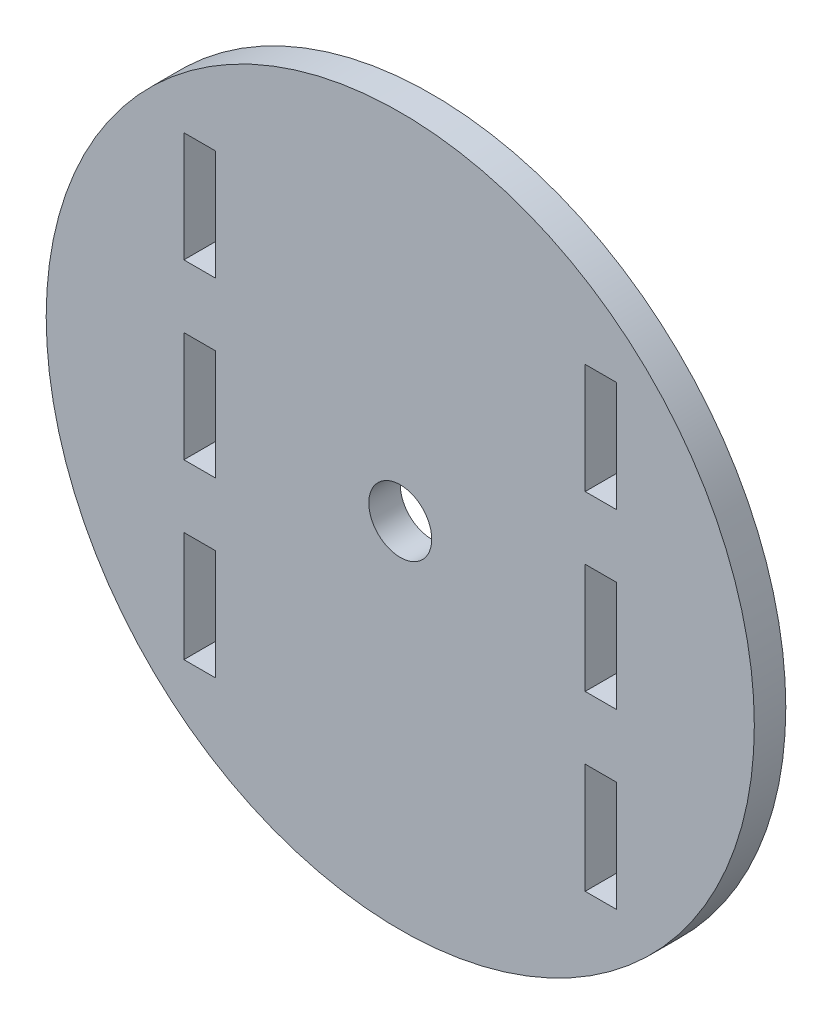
ISO-10303-21;
HEADER;
FILE_DESCRIPTION(('STEP AP214'),'2;1');
FILE_NAME('part.step','',(''),(''),'','','');
FILE_SCHEMA(('AUTOMOTIVE_DESIGN { 1 0 10303 214 1 1 1 1 }'));
ENDSEC;
DATA;
#1=APPLICATION_CONTEXT('core data for automotive mechanical design processes');
#2=APPLICATION_PROTOCOL_DEFINITION('international standard','automotive_design',2000,#1);
#3=PRODUCT_CONTEXT('',#1,'mechanical');
#4=PRODUCT('Part','Part','',(#3));
#5=PRODUCT_RELATED_PRODUCT_CATEGORY('part','',(#4));
#6=PRODUCT_DEFINITION_FORMATION('','',#4);
#7=PRODUCT_DEFINITION_CONTEXT('part definition',#1,'design');
#8=PRODUCT_DEFINITION('design','',#6,#7);
#9=PRODUCT_DEFINITION_SHAPE('','',#8);
#10=(LENGTH_UNIT() NAMED_UNIT(*) SI_UNIT(.MILLI.,.METRE.));
#11=(NAMED_UNIT(*) PLANE_ANGLE_UNIT() SI_UNIT($,.RADIAN.));
#12=(NAMED_UNIT(*) SI_UNIT($,.STERADIAN.) SOLID_ANGLE_UNIT());
#13=UNCERTAINTY_MEASURE_WITH_UNIT(LENGTH_MEASURE(1.E-05),#10,'distance_accuracy_value','');
#14=(GEOMETRIC_REPRESENTATION_CONTEXT(3) GLOBAL_UNCERTAINTY_ASSIGNED_CONTEXT((#13)) GLOBAL_UNIT_ASSIGNED_CONTEXT((#10,
#11,#12)) REPRESENTATION_CONTEXT('',''));
#15=CARTESIAN_POINT('',(0.,0.,0.));
#16=DIRECTION('',(0.,0.,1.));
#17=DIRECTION('',(1.,0.,0.));
#18=AXIS2_PLACEMENT_3D('',#15,#16,#17);
#19=CARTESIAN_POINT('',(45.,147.508099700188,4.));
#20=DIRECTION('',(0.,0.,1.));
#21=DIRECTION('',(1.,0.,0.));
#22=AXIS2_PLACEMENT_3D('',#19,#20,#21);
#23=PLANE('',#22);
#24=CARTESIAN_POINT('',(45.,147.508099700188,4.));
#25=DIRECTION('',(0.,0.,1.));
#26=DIRECTION('',(1.,0.,0.));
#27=AXIS2_PLACEMENT_3D('',#24,#25,#26);
#28=CIRCLE('',#27,45.);
#29=CARTESIAN_POINT('',(90.,147.508099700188,4.));
#30=VERTEX_POINT('',#29);
#31=EDGE_CURVE('E11',#30,#30,#28,.T.);
#32=ORIENTED_EDGE('',*,*,#31,.T.);
#33=EDGE_LOOP('',(#32));
#34=FACE_BOUND('',#33,.T.);
#35=DIRECTION('',(-1.,0.,0.));
#36=VECTOR('',#35,1.);
#37=CARTESIAN_POINT('',(45.,176.508099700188,4.));
#38=LINE('',#37,#36);
#39=CARTESIAN_POINT('',(72.5,176.508099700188,4.));
#40=VERTEX_POINT('',#39);
#41=CARTESIAN_POINT('',(68.5,176.508099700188,4.));
#42=VERTEX_POINT('',#41);
#43=EDGE_CURVE('E375',#40,#42,#38,.T.);
#44=ORIENTED_EDGE('',*,*,#43,.F.);
#45=DIRECTION('',(0.,1.,0.));
#46=VECTOR('',#45,1.);
#47=CARTESIAN_POINT('',(72.5,147.508099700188,4.));
#48=LINE('',#47,#46);
#49=CARTESIAN_POINT('',(72.5,162.508099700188,4.));
#50=VERTEX_POINT('',#49);
#51=EDGE_CURVE('E361',#50,#40,#48,.T.);
#52=ORIENTED_EDGE('',*,*,#51,.F.);
#53=DIRECTION('',(-1.,0.,0.));
#54=VECTOR('',#53,1.);
#55=CARTESIAN_POINT('',(45.,162.508099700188,4.));
#56=LINE('',#55,#54);
#57=CARTESIAN_POINT('',(68.5,162.508099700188,4.));
#58=VERTEX_POINT('',#57);
#59=EDGE_CURVE('E369',#50,#58,#56,.T.);
#60=ORIENTED_EDGE('',*,*,#59,.T.);
#61=DIRECTION('',(0.,1.,0.));
#62=VECTOR('',#61,1.);
#63=CARTESIAN_POINT('',(68.5,147.508099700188,4.));
#64=LINE('',#63,#62);
#65=EDGE_CURVE('E372',#58,#42,#64,.T.);
#66=ORIENTED_EDGE('',*,*,#65,.T.);
#67=EDGE_LOOP('',(#44,#52,#60,#66));
#68=FACE_BOUND('',#67,.T.);
#69=DIRECTION('',(1.,0.,0.));
#70=VECTOR('',#69,1.);
#71=CARTESIAN_POINT('',(45.,140.508099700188,4.));
#72=LINE('',#71,#70);
#73=CARTESIAN_POINT('',(68.5,140.508099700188,4.));
#74=VERTEX_POINT('',#73);
#75=CARTESIAN_POINT('',(72.5,140.508099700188,4.));
#76=VERTEX_POINT('',#75);
#77=EDGE_CURVE('E345',#74,#76,#72,.T.);
#78=ORIENTED_EDGE('',*,*,#77,.F.);
#79=DIRECTION('',(0.,-1.,0.));
#80=VECTOR('',#79,1.);
#81=CARTESIAN_POINT('',(68.5,147.508099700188,4.));
#82=LINE('',#81,#80);
#83=CARTESIAN_POINT('',(68.5,154.508099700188,4.));
#84=VERTEX_POINT('',#83);
#85=EDGE_CURVE('E338',#84,#74,#82,.T.);
#86=ORIENTED_EDGE('',*,*,#85,.F.);
#87=DIRECTION('',(-1.,0.,0.));
#88=VECTOR('',#87,1.);
#89=CARTESIAN_POINT('',(45.,154.508099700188,4.));
#90=LINE('',#89,#88);
#91=CARTESIAN_POINT('',(72.5,154.508099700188,4.));
#92=VERTEX_POINT('',#91);
#93=EDGE_CURVE('E340',#92,#84,#90,.T.);
#94=ORIENTED_EDGE('',*,*,#93,.F.);
#95=DIRECTION('',(0.,1.,0.));
#96=VECTOR('',#95,1.);
#97=CARTESIAN_POINT('',(72.5,147.508099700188,4.));
#98=LINE('',#97,#96);
#99=EDGE_CURVE('E343',#76,#92,#98,.T.);
#100=ORIENTED_EDGE('',*,*,#99,.F.);
#101=EDGE_LOOP('',(#78,#86,#94,#100));
#102=FACE_BOUND('',#101,.T.);
#103=DIRECTION('',(-1.,0.,0.));
#104=VECTOR('',#103,1.);
#105=CARTESIAN_POINT('',(45.,132.508099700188,4.));
#106=LINE('',#105,#104);
#107=CARTESIAN_POINT('',(72.5,132.508099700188,4.));
#108=VERTEX_POINT('',#107);
#109=CARTESIAN_POINT('',(68.5,132.508099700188,4.));
#110=VERTEX_POINT('',#109);
#111=EDGE_CURVE('E316',#108,#110,#106,.T.);
#112=ORIENTED_EDGE('',*,*,#111,.F.);
#113=DIRECTION('',(0.,1.,0.));
#114=VECTOR('',#113,1.);
#115=CARTESIAN_POINT('',(72.5,147.508099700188,4.));
#116=LINE('',#115,#114);
#117=CARTESIAN_POINT('',(72.5,118.508099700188,4.));
#118=VERTEX_POINT('',#117);
#119=EDGE_CURVE('E308',#118,#108,#116,.T.);
#120=ORIENTED_EDGE('',*,*,#119,.F.);
#121=DIRECTION('',(1.,0.,0.));
#122=VECTOR('',#121,1.);
#123=CARTESIAN_POINT('',(45.,118.508099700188,4.));
#124=LINE('',#123,#122);
#125=CARTESIAN_POINT('',(68.5,118.508099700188,4.));
#126=VERTEX_POINT('',#125);
#127=EDGE_CURVE('E310',#126,#118,#124,.T.);
#128=ORIENTED_EDGE('',*,*,#127,.F.);
#129=DIRECTION('',(0.,1.,0.));
#130=VECTOR('',#129,1.);
#131=CARTESIAN_POINT('',(68.5,147.508099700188,4.));
#132=LINE('',#131,#130);
#133=EDGE_CURVE('E313',#126,#110,#132,.T.);
#134=ORIENTED_EDGE('',*,*,#133,.T.);
#135=EDGE_LOOP('',(#112,#120,#128,#134));
#136=FACE_BOUND('',#135,.T.);
#137=DIRECTION('',(-1.,0.,0.));
#138=VECTOR('',#137,1.);
#139=CARTESIAN_POINT('',(45.,176.508099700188,4.));
#140=LINE('',#139,#138);
#141=CARTESIAN_POINT('',(21.5,176.508099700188,4.));
#142=VERTEX_POINT('',#141);
#143=CARTESIAN_POINT('',(17.5,176.508099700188,4.));
#144=VERTEX_POINT('',#143);
#145=EDGE_CURVE('E286',#142,#144,#140,.T.);
#146=ORIENTED_EDGE('',*,*,#145,.F.);
#147=DIRECTION('',(0.,1.,0.));
#148=VECTOR('',#147,1.);
#149=CARTESIAN_POINT('',(21.5,147.508099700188,4.));
#150=LINE('',#149,#148);
#151=CARTESIAN_POINT('',(21.5,162.508099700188,4.));
#152=VERTEX_POINT('',#151);
#153=EDGE_CURVE('E279',#152,#142,#150,.T.);
#154=ORIENTED_EDGE('',*,*,#153,.F.);
#155=DIRECTION('',(-1.,0.,0.));
#156=VECTOR('',#155,1.);
#157=CARTESIAN_POINT('',(45.,162.508099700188,4.));
#158=LINE('',#157,#156);
#159=CARTESIAN_POINT('',(17.5,162.508099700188,4.));
#160=VERTEX_POINT('',#159);
#161=EDGE_CURVE('E281',#152,#160,#158,.T.);
#162=ORIENTED_EDGE('',*,*,#161,.T.);
#163=DIRECTION('',(0.,-1.,0.));
#164=VECTOR('',#163,1.);
#165=CARTESIAN_POINT('',(17.5,147.508099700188,4.));
#166=LINE('',#165,#164);
#167=EDGE_CURVE('E284',#144,#160,#166,.T.);
#168=ORIENTED_EDGE('',*,*,#167,.F.);
#169=EDGE_LOOP('',(#146,#154,#162,#168));
#170=FACE_BOUND('',#169,.T.);
#171=DIRECTION('',(-1.,0.,0.));
#172=VECTOR('',#171,1.);
#173=CARTESIAN_POINT('',(45.,154.508099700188,4.));
#174=LINE('',#173,#172);
#175=CARTESIAN_POINT('',(21.5,154.508099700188,4.));
#176=VERTEX_POINT('',#175);
#177=CARTESIAN_POINT('',(17.5,154.508099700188,4.));
#178=VERTEX_POINT('',#177);
#179=EDGE_CURVE('E257',#176,#178,#174,.T.);
#180=ORIENTED_EDGE('',*,*,#179,.F.);
#181=DIRECTION('',(0.,1.,0.));
#182=VECTOR('',#181,1.);
#183=CARTESIAN_POINT('',(21.5,147.508099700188,4.));
#184=LINE('',#183,#182);
#185=CARTESIAN_POINT('',(21.5,140.508099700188,4.));
#186=VERTEX_POINT('',#185);
#187=EDGE_CURVE('E250',#186,#176,#184,.T.);
#188=ORIENTED_EDGE('',*,*,#187,.F.);
#189=DIRECTION('',(1.,0.,0.));
#190=VECTOR('',#189,1.);
#191=CARTESIAN_POINT('',(45.,140.508099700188,4.));
#192=LINE('',#191,#190);
#193=CARTESIAN_POINT('',(17.5,140.508099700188,4.));
#194=VERTEX_POINT('',#193);
#195=EDGE_CURVE('E252',#194,#186,#192,.T.);
#196=ORIENTED_EDGE('',*,*,#195,.F.);
#197=DIRECTION('',(0.,-1.,0.));
#198=VECTOR('',#197,1.);
#199=CARTESIAN_POINT('',(17.5,147.508099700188,4.));
#200=LINE('',#199,#198);
#201=EDGE_CURVE('E255',#178,#194,#200,.T.);
#202=ORIENTED_EDGE('',*,*,#201,.F.);
#203=EDGE_LOOP('',(#180,#188,#196,#202));
#204=FACE_BOUND('',#203,.T.);
#205=DIRECTION('',(-1.,0.,0.));
#206=VECTOR('',#205,1.);
#207=CARTESIAN_POINT('',(45.,132.508099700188,4.));
#208=LINE('',#207,#206);
#209=CARTESIAN_POINT('',(21.5,132.508099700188,4.));
#210=VERTEX_POINT('',#209);
#211=CARTESIAN_POINT('',(17.5,132.508099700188,4.));
#212=VERTEX_POINT('',#211);
#213=EDGE_CURVE('E198',#210,#212,#208,.T.);
#214=ORIENTED_EDGE('',*,*,#213,.F.);
#215=DIRECTION('',(0.,1.,0.));
#216=VECTOR('',#215,1.);
#217=CARTESIAN_POINT('',(21.5,147.508099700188,4.));
#218=LINE('',#217,#216);
#219=CARTESIAN_POINT('',(21.5,118.508099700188,4.));
#220=VERTEX_POINT('',#219);
#221=EDGE_CURVE('E218',#220,#210,#218,.T.);
#222=ORIENTED_EDGE('',*,*,#221,.F.);
#223=DIRECTION('',(-1.,0.,0.));
#224=VECTOR('',#223,1.);
#225=CARTESIAN_POINT('',(45.,118.508099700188,4.));
#226=LINE('',#225,#224);
#227=CARTESIAN_POINT('',(17.5,118.508099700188,4.));
#228=VERTEX_POINT('',#227);
#229=EDGE_CURVE('E220',#220,#228,#226,.T.);
#230=ORIENTED_EDGE('',*,*,#229,.T.);
#231=DIRECTION('',(0.,1.,0.));
#232=VECTOR('',#231,1.);
#233=CARTESIAN_POINT('',(17.5,147.508099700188,4.));
#234=LINE('',#233,#232);
#235=EDGE_CURVE('E227',#228,#212,#234,.T.);
#236=ORIENTED_EDGE('',*,*,#235,.T.);
#237=EDGE_LOOP('',(#214,#222,#230,#236));
#238=FACE_BOUND('',#237,.T.);
#239=CARTESIAN_POINT('',(45.,147.508099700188,4.));
#240=DIRECTION('',(0.,0.,1.));
#241=DIRECTION('',(1.,0.,0.));
#242=AXIS2_PLACEMENT_3D('',#239,#240,#241);
#243=CIRCLE('',#242,4.);
#244=CARTESIAN_POINT('',(49.,147.508099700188,4.));
#245=VERTEX_POINT('',#244);
#246=EDGE_CURVE('E202',#245,#245,#243,.F.);
#247=ORIENTED_EDGE('',*,*,#246,.T.);
#248=EDGE_LOOP('',(#247));
#249=FACE_BOUND('',#248,.T.);
#250=ADVANCED_FACE('F34',(#34,#68,#102,#136,#170,#204,#238,#249),#23,.T.);
#251=CARTESIAN_POINT('',(45.,147.508099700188,0.));
#252=DIRECTION('',(0.,0.,1.));
#253=DIRECTION('',(1.,0.,0.));
#254=AXIS2_PLACEMENT_3D('',#251,#252,#253);
#255=PLANE('',#254);
#256=CARTESIAN_POINT('',(45.,147.508099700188,0.));
#257=DIRECTION('',(0.,0.,1.));
#258=DIRECTION('',(1.,0.,0.));
#259=AXIS2_PLACEMENT_3D('',#256,#257,#258);
#260=CIRCLE('',#259,45.);
#261=CARTESIAN_POINT('',(90.,147.508099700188,0.));
#262=VERTEX_POINT('',#261);
#263=EDGE_CURVE('E38',#262,#262,#260,.T.);
#264=ORIENTED_EDGE('',*,*,#263,.F.);
#265=EDGE_LOOP('',(#264));
#266=FACE_BOUND('',#265,.T.);
#267=DIRECTION('',(0.,-1.,0.));
#268=VECTOR('',#267,1.);
#269=CARTESIAN_POINT('',(72.5,176.508099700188,0.));
#270=LINE('',#269,#268);
#271=CARTESIAN_POINT('',(72.5,176.508099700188,0.));
#272=VERTEX_POINT('',#271);
#273=CARTESIAN_POINT('',(72.5,162.508099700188,0.));
#274=VERTEX_POINT('',#273);
#275=EDGE_CURVE('E349',#272,#274,#270,.T.);
#276=ORIENTED_EDGE('',*,*,#275,.F.);
#277=DIRECTION('',(1.,0.,0.));
#278=VECTOR('',#277,1.);
#279=CARTESIAN_POINT('',(68.5,176.508099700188,0.));
#280=LINE('',#279,#278);
#281=CARTESIAN_POINT('',(68.5,176.508099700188,0.));
#282=VERTEX_POINT('',#281);
#283=EDGE_CURVE('E347',#282,#272,#280,.T.);
#284=ORIENTED_EDGE('',*,*,#283,.F.);
#285=DIRECTION('',(0.,-1.,0.));
#286=VECTOR('',#285,1.);
#287=CARTESIAN_POINT('',(68.5,176.508099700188,0.));
#288=LINE('',#287,#286);
#289=CARTESIAN_POINT('',(68.5,162.508099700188,0.));
#290=VERTEX_POINT('',#289);
#291=EDGE_CURVE('E355',#282,#290,#288,.T.);
#292=ORIENTED_EDGE('',*,*,#291,.T.);
#293=DIRECTION('',(1.,0.,0.));
#294=VECTOR('',#293,1.);
#295=CARTESIAN_POINT('',(68.5,162.508099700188,0.));
#296=LINE('',#295,#294);
#297=EDGE_CURVE('E352',#290,#274,#296,.T.);
#298=ORIENTED_EDGE('',*,*,#297,.T.);
#299=EDGE_LOOP('',(#276,#284,#292,#298));
#300=FACE_BOUND('',#299,.T.);
#301=DIRECTION('',(0.,1.,0.));
#302=VECTOR('',#301,1.);
#303=CARTESIAN_POINT('',(68.5,140.508099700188,0.));
#304=LINE('',#303,#302);
#305=CARTESIAN_POINT('',(68.5,140.508099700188,0.));
#306=VERTEX_POINT('',#305);
#307=CARTESIAN_POINT('',(68.5,154.508099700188,0.));
#308=VERTEX_POINT('',#307);
#309=EDGE_CURVE('E333',#306,#308,#304,.T.);
#310=ORIENTED_EDGE('',*,*,#309,.F.);
#311=DIRECTION('',(-1.,0.,0.));
#312=VECTOR('',#311,1.);
#313=CARTESIAN_POINT('',(72.5,140.508099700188,0.));
#314=LINE('',#313,#312);
#315=CARTESIAN_POINT('',(72.5,140.508099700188,0.));
#316=VERTEX_POINT('',#315);
#317=EDGE_CURVE('E336',#316,#306,#314,.T.);
#318=ORIENTED_EDGE('',*,*,#317,.F.);
#319=DIRECTION('',(0.,-1.,0.));
#320=VECTOR('',#319,1.);
#321=CARTESIAN_POINT('',(72.5,154.508099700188,0.));
#322=LINE('',#321,#320);
#323=CARTESIAN_POINT('',(72.5,154.508099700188,0.));
#324=VERTEX_POINT('',#323);
#325=EDGE_CURVE('E322',#324,#316,#322,.T.);
#326=ORIENTED_EDGE('',*,*,#325,.F.);
#327=DIRECTION('',(1.,0.,0.));
#328=VECTOR('',#327,1.);
#329=CARTESIAN_POINT('',(68.5,154.508099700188,0.));
#330=LINE('',#329,#328);
#331=EDGE_CURVE('E330',#308,#324,#330,.T.);
#332=ORIENTED_EDGE('',*,*,#331,.F.);
#333=EDGE_LOOP('',(#310,#318,#326,#332));
#334=FACE_BOUND('',#333,.T.);
#335=DIRECTION('',(0.,-1.,0.));
#336=VECTOR('',#335,1.);
#337=CARTESIAN_POINT('',(72.5,132.508099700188,0.));
#338=LINE('',#337,#336);
#339=CARTESIAN_POINT('',(72.5,132.508099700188,0.));
#340=VERTEX_POINT('',#339);
#341=CARTESIAN_POINT('',(72.5,118.508099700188,0.));
#342=VERTEX_POINT('',#341);
#343=EDGE_CURVE('E303',#340,#342,#338,.T.);
#344=ORIENTED_EDGE('',*,*,#343,.F.);
#345=DIRECTION('',(1.,0.,0.));
#346=VECTOR('',#345,1.);
#347=CARTESIAN_POINT('',(68.5,132.508099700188,0.));
#348=LINE('',#347,#346);
#349=CARTESIAN_POINT('',(68.5,132.508099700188,0.));
#350=VERTEX_POINT('',#349);
#351=EDGE_CURVE('E306',#350,#340,#348,.T.);
#352=ORIENTED_EDGE('',*,*,#351,.F.);
#353=DIRECTION('',(0.,-1.,0.));
#354=VECTOR('',#353,1.);
#355=CARTESIAN_POINT('',(68.5,132.508099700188,0.));
#356=LINE('',#355,#354);
#357=CARTESIAN_POINT('',(68.5,118.508099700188,0.));
#358=VERTEX_POINT('',#357);
#359=EDGE_CURVE('E292',#350,#358,#356,.T.);
#360=ORIENTED_EDGE('',*,*,#359,.T.);
#361=DIRECTION('',(-1.,0.,0.));
#362=VECTOR('',#361,1.);
#363=CARTESIAN_POINT('',(72.5,118.508099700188,0.));
#364=LINE('',#363,#362);
#365=EDGE_CURVE('E300',#342,#358,#364,.T.);
#366=ORIENTED_EDGE('',*,*,#365,.F.);
#367=EDGE_LOOP('',(#344,#352,#360,#366));
#368=FACE_BOUND('',#367,.T.);
#369=DIRECTION('',(0.,-1.,0.));
#370=VECTOR('',#369,1.);
#371=CARTESIAN_POINT('',(21.5,176.508099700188,0.));
#372=LINE('',#371,#370);
#373=CARTESIAN_POINT('',(21.5,176.508099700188,0.));
#374=VERTEX_POINT('',#373);
#375=CARTESIAN_POINT('',(21.5,162.508099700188,0.));
#376=VERTEX_POINT('',#375);
#377=EDGE_CURVE('E274',#374,#376,#372,.T.);
#378=ORIENTED_EDGE('',*,*,#377,.F.);
#379=DIRECTION('',(1.,0.,0.));
#380=VECTOR('',#379,1.);
#381=CARTESIAN_POINT('',(17.5,176.508099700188,0.));
#382=LINE('',#381,#380);
#383=CARTESIAN_POINT('',(17.5,176.508099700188,0.));
#384=VERTEX_POINT('',#383);
#385=EDGE_CURVE('E277',#384,#374,#382,.T.);
#386=ORIENTED_EDGE('',*,*,#385,.F.);
#387=DIRECTION('',(0.,1.,0.));
#388=VECTOR('',#387,1.);
#389=CARTESIAN_POINT('',(17.5,162.508099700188,0.));
#390=LINE('',#389,#388);
#391=CARTESIAN_POINT('',(17.5,162.508099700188,0.));
#392=VERTEX_POINT('',#391);
#393=EDGE_CURVE('E263',#392,#384,#390,.T.);
#394=ORIENTED_EDGE('',*,*,#393,.F.);
#395=DIRECTION('',(1.,0.,0.));
#396=VECTOR('',#395,1.);
#397=CARTESIAN_POINT('',(17.5,162.508099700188,0.));
#398=LINE('',#397,#396);
#399=EDGE_CURVE('E271',#392,#376,#398,.T.);
#400=ORIENTED_EDGE('',*,*,#399,.T.);
#401=EDGE_LOOP('',(#378,#386,#394,#400));
#402=FACE_BOUND('',#401,.T.);
#403=DIRECTION('',(0.,-1.,0.));
#404=VECTOR('',#403,1.);
#405=CARTESIAN_POINT('',(21.5,154.508099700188,0.));
#406=LINE('',#405,#404);
#407=CARTESIAN_POINT('',(21.5,154.508099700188,0.));
#408=VERTEX_POINT('',#407);
#409=CARTESIAN_POINT('',(21.5,140.508099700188,0.));
#410=VERTEX_POINT('',#409);
#411=EDGE_CURVE('E245',#408,#410,#406,.T.);
#412=ORIENTED_EDGE('',*,*,#411,.F.);
#413=DIRECTION('',(1.,0.,0.));
#414=VECTOR('',#413,1.);
#415=CARTESIAN_POINT('',(17.5,154.508099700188,0.));
#416=LINE('',#415,#414);
#417=CARTESIAN_POINT('',(17.5,154.508099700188,0.));
#418=VERTEX_POINT('',#417);
#419=EDGE_CURVE('E248',#418,#408,#416,.T.);
#420=ORIENTED_EDGE('',*,*,#419,.F.);
#421=DIRECTION('',(0.,1.,0.));
#422=VECTOR('',#421,1.);
#423=CARTESIAN_POINT('',(17.5,140.508099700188,0.));
#424=LINE('',#423,#422);
#425=CARTESIAN_POINT('',(17.5,140.508099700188,0.));
#426=VERTEX_POINT('',#425);
#427=EDGE_CURVE('E234',#426,#418,#424,.T.);
#428=ORIENTED_EDGE('',*,*,#427,.F.);
#429=DIRECTION('',(-1.,0.,0.));
#430=VECTOR('',#429,1.);
#431=CARTESIAN_POINT('',(21.5,140.508099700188,0.));
#432=LINE('',#431,#430);
#433=EDGE_CURVE('E242',#410,#426,#432,.T.);
#434=ORIENTED_EDGE('',*,*,#433,.F.);
#435=EDGE_LOOP('',(#412,#420,#428,#434));
#436=FACE_BOUND('',#435,.T.);
#437=DIRECTION('',(0.,-1.,0.));
#438=VECTOR('',#437,1.);
#439=CARTESIAN_POINT('',(21.5,132.508099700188,0.));
#440=LINE('',#439,#438);
#441=CARTESIAN_POINT('',(21.5,132.508099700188,0.));
#442=VERTEX_POINT('',#441);
#443=CARTESIAN_POINT('',(21.5,118.508099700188,0.));
#444=VERTEX_POINT('',#443);
#445=EDGE_CURVE('E217',#442,#444,#440,.T.);
#446=ORIENTED_EDGE('',*,*,#445,.F.);
#447=DIRECTION('',(1.,0.,0.));
#448=VECTOR('',#447,1.);
#449=CARTESIAN_POINT('',(17.5,132.508099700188,0.));
#450=LINE('',#449,#448);
#451=CARTESIAN_POINT('',(17.5,132.508099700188,0.));
#452=VERTEX_POINT('',#451);
#453=EDGE_CURVE('E57',#452,#442,#450,.T.);
#454=ORIENTED_EDGE('',*,*,#453,.F.);
#455=DIRECTION('',(0.,-1.,0.));
#456=VECTOR('',#455,1.);
#457=CARTESIAN_POINT('',(17.5,132.508099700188,0.));
#458=LINE('',#457,#456);
#459=CARTESIAN_POINT('',(17.5,118.508099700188,0.));
#460=VERTEX_POINT('',#459);
#461=EDGE_CURVE('E205',#452,#460,#458,.T.);
#462=ORIENTED_EDGE('',*,*,#461,.T.);
#463=DIRECTION('',(1.,0.,0.));
#464=VECTOR('',#463,1.);
#465=CARTESIAN_POINT('',(17.5,118.508099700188,0.));
#466=LINE('',#465,#464);
#467=EDGE_CURVE('E211',#460,#444,#466,.T.);
#468=ORIENTED_EDGE('',*,*,#467,.T.);
#469=EDGE_LOOP('',(#446,#454,#462,#468));
#470=FACE_BOUND('',#469,.T.);
#471=CARTESIAN_POINT('',(45.,147.508099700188,0.));
#472=DIRECTION('',(0.,0.,1.));
#473=DIRECTION('',(1.,0.,0.));
#474=AXIS2_PLACEMENT_3D('',#471,#472,#473);
#475=CIRCLE('',#474,4.);
#476=CARTESIAN_POINT('',(49.,147.508099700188,0.));
#477=VERTEX_POINT('',#476);
#478=EDGE_CURVE('E598',#477,#477,#475,.T.);
#479=ORIENTED_EDGE('',*,*,#478,.T.);
#480=EDGE_LOOP('',(#479));
#481=FACE_BOUND('',#480,.T.);
#482=ADVANCED_FACE('F215',(#266,#300,#334,#368,#402,#436,#470,#481),#255,.F.);
#483=CARTESIAN_POINT('',(45.,147.508099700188,4.));
#484=DIRECTION('',(0.,0.,-1.));
#485=DIRECTION('',(-1.,0.,0.));
#486=AXIS2_PLACEMENT_3D('',#483,#484,#485);
#487=CYLINDRICAL_SURFACE('',#486,45.);
#488=ORIENTED_EDGE('',*,*,#31,.F.);
#489=EDGE_LOOP('',(#488));
#490=FACE_BOUND('',#489,.T.);
#491=ORIENTED_EDGE('',*,*,#263,.T.);
#492=EDGE_LOOP('',(#491));
#493=FACE_BOUND('',#492,.T.);
#494=ADVANCED_FACE('F36',(#490,#493),#487,.T.);
#495=CARTESIAN_POINT('',(68.5,176.508099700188,35.));
#496=DIRECTION('',(0.,1.,0.));
#497=DIRECTION('',(0.,0.,1.));
#498=AXIS2_PLACEMENT_3D('',#495,#496,#497);
#499=PLANE('',#498);
#500=ORIENTED_EDGE('',*,*,#43,.T.);
#501=DIRECTION('',(0.,0.,-1.));
#502=VECTOR('',#501,1.);
#503=CARTESIAN_POINT('',(68.5,176.508099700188,35.));
#504=LINE('',#503,#502);
#505=EDGE_CURVE('E359',#42,#282,#504,.T.);
#506=ORIENTED_EDGE('',*,*,#505,.T.);
#507=ORIENTED_EDGE('',*,*,#283,.T.);
#508=DIRECTION('',(0.,0.,-1.));
#509=VECTOR('',#508,1.);
#510=CARTESIAN_POINT('',(72.5,176.508099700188,35.));
#511=LINE('',#510,#509);
#512=EDGE_CURVE('E358',#40,#272,#511,.T.);
#513=ORIENTED_EDGE('',*,*,#512,.F.);
#514=EDGE_LOOP('',(#500,#506,#507,#513));
#515=FACE_BOUND('',#514,.T.);
#516=ADVANCED_FACE('F436',(#515),#499,.F.);
#517=CARTESIAN_POINT('',(68.5,176.508099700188,35.));
#518=DIRECTION('',(1.,0.,0.));
#519=DIRECTION('',(0.,0.,-1.));
#520=AXIS2_PLACEMENT_3D('',#517,#518,#519);
#521=PLANE('',#520);
#522=DIRECTION('',(0.,0.,-1.));
#523=VECTOR('',#522,1.);
#524=CARTESIAN_POINT('',(68.5,162.508099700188,35.));
#525=LINE('',#524,#523);
#526=EDGE_CURVE('E362',#58,#290,#525,.T.);
#527=ORIENTED_EDGE('',*,*,#526,.T.);
#528=ORIENTED_EDGE('',*,*,#291,.F.);
#529=ORIENTED_EDGE('',*,*,#505,.F.);
#530=ORIENTED_EDGE('',*,*,#65,.F.);
#531=EDGE_LOOP('',(#527,#528,#529,#530));
#532=FACE_BOUND('',#531,.T.);
#533=ADVANCED_FACE('F439',(#532),#521,.T.);
#534=CARTESIAN_POINT('',(68.5,162.508099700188,35.));
#535=DIRECTION('',(0.,1.,0.));
#536=DIRECTION('',(0.,0.,1.));
#537=AXIS2_PLACEMENT_3D('',#534,#535,#536);
#538=PLANE('',#537);
#539=DIRECTION('',(0.,0.,-1.));
#540=VECTOR('',#539,1.);
#541=CARTESIAN_POINT('',(72.5,162.508099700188,35.));
#542=LINE('',#541,#540);
#543=EDGE_CURVE('E364',#50,#274,#542,.T.);
#544=ORIENTED_EDGE('',*,*,#543,.T.);
#545=ORIENTED_EDGE('',*,*,#297,.F.);
#546=ORIENTED_EDGE('',*,*,#526,.F.);
#547=ORIENTED_EDGE('',*,*,#59,.F.);
#548=EDGE_LOOP('',(#544,#545,#546,#547));
#549=FACE_BOUND('',#548,.T.);
#550=ADVANCED_FACE('F444',(#549),#538,.T.);
#551=CARTESIAN_POINT('',(72.5,176.508099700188,35.));
#552=DIRECTION('',(1.,0.,0.));
#553=DIRECTION('',(0.,0.,-1.));
#554=AXIS2_PLACEMENT_3D('',#551,#552,#553);
#555=PLANE('',#554);
#556=ORIENTED_EDGE('',*,*,#51,.T.);
#557=ORIENTED_EDGE('',*,*,#512,.T.);
#558=ORIENTED_EDGE('',*,*,#275,.T.);
#559=ORIENTED_EDGE('',*,*,#543,.F.);
#560=EDGE_LOOP('',(#556,#557,#558,#559));
#561=FACE_BOUND('',#560,.T.);
#562=ADVANCED_FACE('F440',(#561),#555,.F.);
#563=CARTESIAN_POINT('',(72.5,140.508099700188,35.));
#564=DIRECTION('',(0.,-1.,0.));
#565=DIRECTION('',(0.,0.,-1.));
#566=AXIS2_PLACEMENT_3D('',#563,#564,#565);
#567=PLANE('',#566);
#568=ORIENTED_EDGE('',*,*,#77,.T.);
#569=DIRECTION('',(0.,0.,-1.));
#570=VECTOR('',#569,1.);
#571=CARTESIAN_POINT('',(72.5,140.508099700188,35.));
#572=LINE('',#571,#570);
#573=EDGE_CURVE('E318',#76,#316,#572,.T.);
#574=ORIENTED_EDGE('',*,*,#573,.T.);
#575=ORIENTED_EDGE('',*,*,#317,.T.);
#576=DIRECTION('',(0.,0.,-1.));
#577=VECTOR('',#576,1.);
#578=CARTESIAN_POINT('',(68.5,140.508099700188,35.));
#579=LINE('',#578,#577);
#580=EDGE_CURVE('E319',#74,#306,#579,.T.);
#581=ORIENTED_EDGE('',*,*,#580,.F.);
#582=EDGE_LOOP('',(#568,#574,#575,#581));
#583=FACE_BOUND('',#582,.T.);
#584=ADVANCED_FACE('F443',(#583),#567,.F.);
#585=CARTESIAN_POINT('',(72.5,154.508099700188,35.));
#586=DIRECTION('',(1.,0.,0.));
#587=DIRECTION('',(0.,0.,-1.));
#588=AXIS2_PLACEMENT_3D('',#585,#586,#587);
#589=PLANE('',#588);
#590=ORIENTED_EDGE('',*,*,#99,.T.);
#591=DIRECTION('',(0.,0.,-1.));
#592=VECTOR('',#591,1.);
#593=CARTESIAN_POINT('',(72.5,154.508099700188,35.));
#594=LINE('',#593,#592);
#595=EDGE_CURVE('E325',#92,#324,#594,.T.);
#596=ORIENTED_EDGE('',*,*,#595,.T.);
#597=ORIENTED_EDGE('',*,*,#325,.T.);
#598=ORIENTED_EDGE('',*,*,#573,.F.);
#599=EDGE_LOOP('',(#590,#596,#597,#598));
#600=FACE_BOUND('',#599,.T.);
#601=ADVANCED_FACE('F452',(#600),#589,.F.);
#602=CARTESIAN_POINT('',(68.5,154.508099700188,35.));
#603=DIRECTION('',(0.,1.,0.));
#604=DIRECTION('',(0.,0.,1.));
#605=AXIS2_PLACEMENT_3D('',#602,#603,#604);
#606=PLANE('',#605);
#607=ORIENTED_EDGE('',*,*,#93,.T.);
#608=DIRECTION('',(0.,0.,-1.));
#609=VECTOR('',#608,1.);
#610=CARTESIAN_POINT('',(68.5,154.508099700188,35.));
#611=LINE('',#610,#609);
#612=EDGE_CURVE('E323',#84,#308,#611,.T.);
#613=ORIENTED_EDGE('',*,*,#612,.T.);
#614=ORIENTED_EDGE('',*,*,#331,.T.);
#615=ORIENTED_EDGE('',*,*,#595,.F.);
#616=EDGE_LOOP('',(#607,#613,#614,#615));
#617=FACE_BOUND('',#616,.T.);
#618=ADVANCED_FACE('F455',(#617),#606,.F.);
#619=CARTESIAN_POINT('',(68.5,140.508099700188,35.));
#620=DIRECTION('',(-1.,0.,0.));
#621=DIRECTION('',(0.,0.,1.));
#622=AXIS2_PLACEMENT_3D('',#619,#620,#621);
#623=PLANE('',#622);
#624=ORIENTED_EDGE('',*,*,#85,.T.);
#625=ORIENTED_EDGE('',*,*,#580,.T.);
#626=ORIENTED_EDGE('',*,*,#309,.T.);
#627=ORIENTED_EDGE('',*,*,#612,.F.);
#628=EDGE_LOOP('',(#624,#625,#626,#627));
#629=FACE_BOUND('',#628,.T.);
#630=ADVANCED_FACE('F459',(#629),#623,.F.);
#631=CARTESIAN_POINT('',(68.5,132.508099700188,35.));
#632=DIRECTION('',(0.,1.,0.));
#633=DIRECTION('',(0.,0.,1.));
#634=AXIS2_PLACEMENT_3D('',#631,#632,#633);
#635=PLANE('',#634);
#636=ORIENTED_EDGE('',*,*,#111,.T.);
#637=DIRECTION('',(0.,0.,-1.));
#638=VECTOR('',#637,1.);
#639=CARTESIAN_POINT('',(68.5,132.508099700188,35.));
#640=LINE('',#639,#638);
#641=EDGE_CURVE('E288',#110,#350,#640,.T.);
#642=ORIENTED_EDGE('',*,*,#641,.T.);
#643=ORIENTED_EDGE('',*,*,#351,.T.);
#644=DIRECTION('',(0.,0.,-1.));
#645=VECTOR('',#644,1.);
#646=CARTESIAN_POINT('',(72.5,132.508099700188,35.));
#647=LINE('',#646,#645);
#648=EDGE_CURVE('E289',#108,#340,#647,.T.);
#649=ORIENTED_EDGE('',*,*,#648,.F.);
#650=EDGE_LOOP('',(#636,#642,#643,#649));
#651=FACE_BOUND('',#650,.T.);
#652=ADVANCED_FACE('F463',(#651),#635,.F.);
#653=CARTESIAN_POINT('',(68.5,132.508099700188,35.));
#654=DIRECTION('',(1.,0.,0.));
#655=DIRECTION('',(0.,0.,-1.));
#656=AXIS2_PLACEMENT_3D('',#653,#654,#655);
#657=PLANE('',#656);
#658=DIRECTION('',(0.,0.,-1.));
#659=VECTOR('',#658,1.);
#660=CARTESIAN_POINT('',(68.5,118.508099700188,35.));
#661=LINE('',#660,#659);
#662=EDGE_CURVE('E295',#126,#358,#661,.T.);
#663=ORIENTED_EDGE('',*,*,#662,.T.);
#664=ORIENTED_EDGE('',*,*,#359,.F.);
#665=ORIENTED_EDGE('',*,*,#641,.F.);
#666=ORIENTED_EDGE('',*,*,#133,.F.);
#667=EDGE_LOOP('',(#663,#664,#665,#666));
#668=FACE_BOUND('',#667,.T.);
#669=ADVANCED_FACE('F468',(#668),#657,.T.);
#670=CARTESIAN_POINT('',(72.5,118.508099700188,35.));
#671=DIRECTION('',(0.,-1.,0.));
#672=DIRECTION('',(0.,0.,-1.));
#673=AXIS2_PLACEMENT_3D('',#670,#671,#672);
#674=PLANE('',#673);
#675=ORIENTED_EDGE('',*,*,#127,.T.);
#676=DIRECTION('',(0.,0.,-1.));
#677=VECTOR('',#676,1.);
#678=CARTESIAN_POINT('',(72.5,118.508099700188,35.));
#679=LINE('',#678,#677);
#680=EDGE_CURVE('E293',#118,#342,#679,.T.);
#681=ORIENTED_EDGE('',*,*,#680,.T.);
#682=ORIENTED_EDGE('',*,*,#365,.T.);
#683=ORIENTED_EDGE('',*,*,#662,.F.);
#684=EDGE_LOOP('',(#675,#681,#682,#683));
#685=FACE_BOUND('',#684,.T.);
#686=ADVANCED_FACE('F471',(#685),#674,.F.);
#687=CARTESIAN_POINT('',(72.5,132.508099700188,35.));
#688=DIRECTION('',(1.,0.,0.));
#689=DIRECTION('',(0.,0.,-1.));
#690=AXIS2_PLACEMENT_3D('',#687,#688,#689);
#691=PLANE('',#690);
#692=ORIENTED_EDGE('',*,*,#119,.T.);
#693=ORIENTED_EDGE('',*,*,#648,.T.);
#694=ORIENTED_EDGE('',*,*,#343,.T.);
#695=ORIENTED_EDGE('',*,*,#680,.F.);
#696=EDGE_LOOP('',(#692,#693,#694,#695));
#697=FACE_BOUND('',#696,.T.);
#698=ADVANCED_FACE('F475',(#697),#691,.F.);
#699=CARTESIAN_POINT('',(17.5,176.508099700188,35.));
#700=DIRECTION('',(0.,1.,0.));
#701=DIRECTION('',(0.,0.,1.));
#702=AXIS2_PLACEMENT_3D('',#699,#700,#701);
#703=PLANE('',#702);
#704=ORIENTED_EDGE('',*,*,#145,.T.);
#705=DIRECTION('',(0.,0.,-1.));
#706=VECTOR('',#705,1.);
#707=CARTESIAN_POINT('',(17.5,176.508099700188,35.));
#708=LINE('',#707,#706);
#709=EDGE_CURVE('E259',#144,#384,#708,.T.);
#710=ORIENTED_EDGE('',*,*,#709,.T.);
#711=ORIENTED_EDGE('',*,*,#385,.T.);
#712=DIRECTION('',(0.,0.,-1.));
#713=VECTOR('',#712,1.);
#714=CARTESIAN_POINT('',(21.5,176.508099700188,35.));
#715=LINE('',#714,#713);
#716=EDGE_CURVE('E260',#142,#374,#715,.T.);
#717=ORIENTED_EDGE('',*,*,#716,.F.);
#718=EDGE_LOOP('',(#704,#710,#711,#717));
#719=FACE_BOUND('',#718,.T.);
#720=ADVANCED_FACE('F479',(#719),#703,.F.);
#721=CARTESIAN_POINT('',(17.5,162.508099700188,35.));
#722=DIRECTION('',(-1.,0.,0.));
#723=DIRECTION('',(0.,0.,1.));
#724=AXIS2_PLACEMENT_3D('',#721,#722,#723);
#725=PLANE('',#724);
#726=ORIENTED_EDGE('',*,*,#167,.T.);
#727=DIRECTION('',(0.,0.,-1.));
#728=VECTOR('',#727,1.);
#729=CARTESIAN_POINT('',(17.5,162.508099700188,35.));
#730=LINE('',#729,#728);
#731=EDGE_CURVE('E266',#160,#392,#730,.T.);
#732=ORIENTED_EDGE('',*,*,#731,.T.);
#733=ORIENTED_EDGE('',*,*,#393,.T.);
#734=ORIENTED_EDGE('',*,*,#709,.F.);
#735=EDGE_LOOP('',(#726,#732,#733,#734));
#736=FACE_BOUND('',#735,.T.);
#737=ADVANCED_FACE('F484',(#736),#725,.F.);
#738=CARTESIAN_POINT('',(17.5,162.508099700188,35.));
#739=DIRECTION('',(0.,1.,0.));
#740=DIRECTION('',(0.,0.,1.));
#741=AXIS2_PLACEMENT_3D('',#738,#739,#740);
#742=PLANE('',#741);
#743=DIRECTION('',(0.,0.,-1.));
#744=VECTOR('',#743,1.);
#745=CARTESIAN_POINT('',(21.5,162.508099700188,35.));
#746=LINE('',#745,#744);
#747=EDGE_CURVE('E264',#152,#376,#746,.T.);
#748=ORIENTED_EDGE('',*,*,#747,.T.);
#749=ORIENTED_EDGE('',*,*,#399,.F.);
#750=ORIENTED_EDGE('',*,*,#731,.F.);
#751=ORIENTED_EDGE('',*,*,#161,.F.);
#752=EDGE_LOOP('',(#748,#749,#750,#751));
#753=FACE_BOUND('',#752,.T.);
#754=ADVANCED_FACE('F487',(#753),#742,.T.);
#755=CARTESIAN_POINT('',(21.5,176.508099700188,35.));
#756=DIRECTION('',(1.,0.,0.));
#757=DIRECTION('',(0.,0.,-1.));
#758=AXIS2_PLACEMENT_3D('',#755,#756,#757);
#759=PLANE('',#758);
#760=ORIENTED_EDGE('',*,*,#153,.T.);
#761=ORIENTED_EDGE('',*,*,#716,.T.);
#762=ORIENTED_EDGE('',*,*,#377,.T.);
#763=ORIENTED_EDGE('',*,*,#747,.F.);
#764=EDGE_LOOP('',(#760,#761,#762,#763));
#765=FACE_BOUND('',#764,.T.);
#766=ADVANCED_FACE('F491',(#765),#759,.F.);
#767=CARTESIAN_POINT('',(17.5,154.508099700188,35.));
#768=DIRECTION('',(0.,1.,0.));
#769=DIRECTION('',(0.,0.,1.));
#770=AXIS2_PLACEMENT_3D('',#767,#768,#769);
#771=PLANE('',#770);
#772=ORIENTED_EDGE('',*,*,#179,.T.);
#773=DIRECTION('',(0.,0.,-1.));
#774=VECTOR('',#773,1.);
#775=CARTESIAN_POINT('',(17.5,154.508099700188,35.));
#776=LINE('',#775,#774);
#777=EDGE_CURVE('E230',#178,#418,#776,.T.);
#778=ORIENTED_EDGE('',*,*,#777,.T.);
#779=ORIENTED_EDGE('',*,*,#419,.T.);
#780=DIRECTION('',(0.,0.,-1.));
#781=VECTOR('',#780,1.);
#782=CARTESIAN_POINT('',(21.5,154.508099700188,35.));
#783=LINE('',#782,#781);
#784=EDGE_CURVE('E231',#176,#408,#783,.T.);
#785=ORIENTED_EDGE('',*,*,#784,.F.);
#786=EDGE_LOOP('',(#772,#778,#779,#785));
#787=FACE_BOUND('',#786,.T.);
#788=ADVANCED_FACE('F410',(#787),#771,.F.);
#789=CARTESIAN_POINT('',(17.5,140.508099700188,35.));
#790=DIRECTION('',(-1.,0.,0.));
#791=DIRECTION('',(0.,0.,1.));
#792=AXIS2_PLACEMENT_3D('',#789,#790,#791);
#793=PLANE('',#792);
#794=ORIENTED_EDGE('',*,*,#201,.T.);
#795=DIRECTION('',(0.,0.,-1.));
#796=VECTOR('',#795,1.);
#797=CARTESIAN_POINT('',(17.5,140.508099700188,35.));
#798=LINE('',#797,#796);
#799=EDGE_CURVE('E237',#194,#426,#798,.T.);
#800=ORIENTED_EDGE('',*,*,#799,.T.);
#801=ORIENTED_EDGE('',*,*,#427,.T.);
#802=ORIENTED_EDGE('',*,*,#777,.F.);
#803=EDGE_LOOP('',(#794,#800,#801,#802));
#804=FACE_BOUND('',#803,.T.);
#805=ADVANCED_FACE('F418',(#804),#793,.F.);
#806=CARTESIAN_POINT('',(21.5,140.508099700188,35.));
#807=DIRECTION('',(0.,-1.,0.));
#808=DIRECTION('',(0.,0.,-1.));
#809=AXIS2_PLACEMENT_3D('',#806,#807,#808);
#810=PLANE('',#809);
#811=ORIENTED_EDGE('',*,*,#195,.T.);
#812=DIRECTION('',(0.,0.,-1.));
#813=VECTOR('',#812,1.);
#814=CARTESIAN_POINT('',(21.5,140.508099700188,35.));
#815=LINE('',#814,#813);
#816=EDGE_CURVE('E235',#186,#410,#815,.T.);
#817=ORIENTED_EDGE('',*,*,#816,.T.);
#818=ORIENTED_EDGE('',*,*,#433,.T.);
#819=ORIENTED_EDGE('',*,*,#799,.F.);
#820=EDGE_LOOP('',(#811,#817,#818,#819));
#821=FACE_BOUND('',#820,.T.);
#822=ADVANCED_FACE('F420',(#821),#810,.F.);
#823=CARTESIAN_POINT('',(21.5,154.508099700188,35.));
#824=DIRECTION('',(1.,0.,0.));
#825=DIRECTION('',(0.,0.,-1.));
#826=AXIS2_PLACEMENT_3D('',#823,#824,#825);
#827=PLANE('',#826);
#828=ORIENTED_EDGE('',*,*,#187,.T.);
#829=ORIENTED_EDGE('',*,*,#784,.T.);
#830=ORIENTED_EDGE('',*,*,#411,.T.);
#831=ORIENTED_EDGE('',*,*,#816,.F.);
#832=EDGE_LOOP('',(#828,#829,#830,#831));
#833=FACE_BOUND('',#832,.T.);
#834=ADVANCED_FACE('F405',(#833),#827,.F.);
#835=CARTESIAN_POINT('',(17.5,132.508099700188,35.));
#836=DIRECTION('',(0.,1.,0.));
#837=DIRECTION('',(0.,0.,1.));
#838=AXIS2_PLACEMENT_3D('',#835,#836,#837);
#839=PLANE('',#838);
#840=ORIENTED_EDGE('',*,*,#213,.T.);
#841=DIRECTION('',(0.,0.,-1.));
#842=VECTOR('',#841,1.);
#843=CARTESIAN_POINT('',(17.5,132.508099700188,35.));
#844=LINE('',#843,#842);
#845=EDGE_CURVE('E194',#212,#452,#844,.T.);
#846=ORIENTED_EDGE('',*,*,#845,.T.);
#847=ORIENTED_EDGE('',*,*,#453,.T.);
#848=DIRECTION('',(0.,0.,-1.));
#849=VECTOR('',#848,1.);
#850=CARTESIAN_POINT('',(21.5,132.508099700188,35.));
#851=LINE('',#850,#849);
#852=EDGE_CURVE('E212',#210,#442,#851,.T.);
#853=ORIENTED_EDGE('',*,*,#852,.F.);
#854=EDGE_LOOP('',(#840,#846,#847,#853));
#855=FACE_BOUND('',#854,.T.);
#856=ADVANCED_FACE('F196',(#855),#839,.F.);
#857=CARTESIAN_POINT('',(17.5,132.508099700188,35.));
#858=DIRECTION('',(1.,0.,0.));
#859=DIRECTION('',(0.,0.,-1.));
#860=AXIS2_PLACEMENT_3D('',#857,#858,#859);
#861=PLANE('',#860);
#862=DIRECTION('',(0.,0.,-1.));
#863=VECTOR('',#862,1.);
#864=CARTESIAN_POINT('',(17.5,118.508099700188,35.));
#865=LINE('',#864,#863);
#866=EDGE_CURVE('E201',#228,#460,#865,.T.);
#867=ORIENTED_EDGE('',*,*,#866,.T.);
#868=ORIENTED_EDGE('',*,*,#461,.F.);
#869=ORIENTED_EDGE('',*,*,#845,.F.);
#870=ORIENTED_EDGE('',*,*,#235,.F.);
#871=EDGE_LOOP('',(#867,#868,#869,#870));
#872=FACE_BOUND('',#871,.T.);
#873=ADVANCED_FACE('F206',(#872),#861,.T.);
#874=CARTESIAN_POINT('',(17.5,118.508099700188,35.));
#875=DIRECTION('',(0.,1.,0.));
#876=DIRECTION('',(0.,0.,1.));
#877=AXIS2_PLACEMENT_3D('',#874,#875,#876);
#878=PLANE('',#877);
#879=DIRECTION('',(0.,0.,-1.));
#880=VECTOR('',#879,1.);
#881=CARTESIAN_POINT('',(21.5,118.508099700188,35.));
#882=LINE('',#881,#880);
#883=EDGE_CURVE('E49',#220,#444,#882,.T.);
#884=ORIENTED_EDGE('',*,*,#883,.T.);
#885=ORIENTED_EDGE('',*,*,#467,.F.);
#886=ORIENTED_EDGE('',*,*,#866,.F.);
#887=ORIENTED_EDGE('',*,*,#229,.F.);
#888=EDGE_LOOP('',(#884,#885,#886,#887));
#889=FACE_BOUND('',#888,.T.);
#890=ADVANCED_FACE('F561',(#889),#878,.T.);
#891=CARTESIAN_POINT('',(21.5,132.508099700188,35.));
#892=DIRECTION('',(1.,0.,0.));
#893=DIRECTION('',(0.,0.,-1.));
#894=AXIS2_PLACEMENT_3D('',#891,#892,#893);
#895=PLANE('',#894);
#896=ORIENTED_EDGE('',*,*,#221,.T.);
#897=ORIENTED_EDGE('',*,*,#852,.T.);
#898=ORIENTED_EDGE('',*,*,#445,.T.);
#899=ORIENTED_EDGE('',*,*,#883,.F.);
#900=EDGE_LOOP('',(#896,#897,#898,#899));
#901=FACE_BOUND('',#900,.T.);
#902=ADVANCED_FACE('F570',(#901),#895,.F.);
#903=CARTESIAN_POINT('',(45.,147.508099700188,35.));
#904=DIRECTION('',(0.,0.,-1.));
#905=DIRECTION('',(-1.,0.,0.));
#906=AXIS2_PLACEMENT_3D('',#903,#904,#905);
#907=CYLINDRICAL_SURFACE('',#906,4.);
#908=ORIENTED_EDGE('',*,*,#246,.F.);
#909=EDGE_LOOP('',(#908));
#910=FACE_BOUND('',#909,.T.);
#911=ORIENTED_EDGE('',*,*,#478,.F.);
#912=EDGE_LOOP('',(#911));
#913=FACE_BOUND('',#912,.T.);
#914=ADVANCED_FACE('F580',(#910,#913),#907,.F.);
#915=CLOSED_SHELL('',(#250,#482,#494,#516,#533,#550,#562,#584,#601,#618,#630,#652,#669,#686,
#698,#720,#737,#754,#766,#788,#805,#822,#834,#856,#873,#890,#902,#914));
#916=MANIFOLD_SOLID_BREP('B2',#915);
#917=ADVANCED_BREP_SHAPE_REPRESENTATION('',(#18,#916),#14);
#918=SHAPE_DEFINITION_REPRESENTATION(#9,#917);
ENDSEC;
END-ISO-10303-21;
